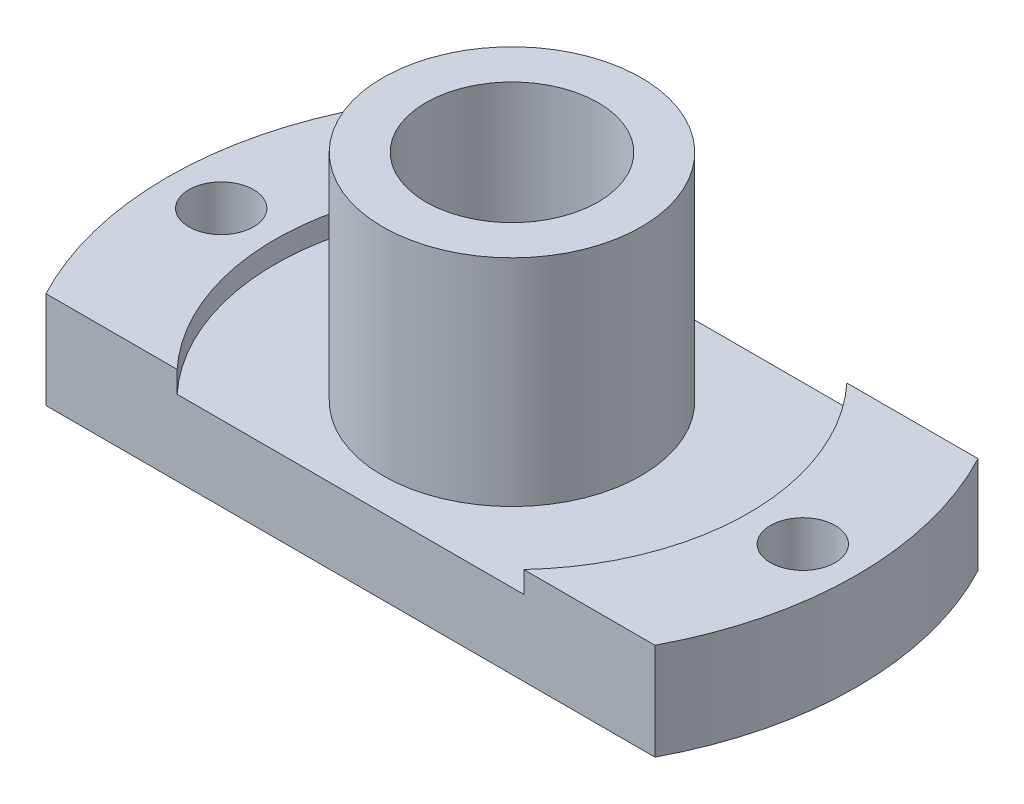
from build123d import *

# Parameters (mm, degrees)
SKETCH_1_R          = 12
SKETCH_1_R_2        = 8
EXTRUDE_1_DEPTH     = 27
SKETCH_2_R          = 8
EXTRUDE_2_DEPTH     = 7
EXTRUDE_3_DEPTH     = 2
SKETCH_4_R          = 3
CUT_EXTRUDE_1_DEPTH = 40.66106403


with BuildPart() as part:
    # Sketch 1 → Extrude 1 (new body)
    with BuildSketch(Plane(origin=(0, 0, 0), x_dir=(1, 0, 0), z_dir=(0, 1, 0))):
        with Locations(Location((0, 0, 0), (0, 0, 270))):
            Circle(SKETCH_1_R)
        with Locations(Location((0, 0, 0), (0, 0, 270))):
            Circle(SKETCH_1_R_2, mode=Mode.SUBTRACT)
    extrude(amount=EXTRUDE_1_DEPTH)

    # Sketch 2 → Extrude 2 (add)
    with BuildSketch(Plane.XZ):
        with BuildLine():
            Line((-28.26658805, -15), (28.26658805, -15))
            ThreePointArc((28.26658805, -15), (32, 0), (28.26658805, 15))
            Line((28.26658805, 15), (-28.26658805, 15))
            ThreePointArc((-28.26658805, 15), (-32, 0), (-28.26658805, -15))
        make_face()
        with Locations(Location((0, 0, 0), (0, 0, 90))):
            Circle(SKETCH_2_R, mode=Mode.SUBTRACT)
    extrude(amount=-EXTRUDE_2_DEPTH)

    # Sketch 3 → Extrude 3 (add)
    with BuildSketch(Plane(origin=(0, 7, 0), x_dir=(1, 0, 0), z_dir=(0, 1, 0))):
        with BuildLine():
            Line((28.26658805, 15), (16.093476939, 15))
            ThreePointArc((16.093476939, 15), (22, 0), (16.093476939, -15))
            Line((16.093476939, -15), (28.26658805, -15))
            ThreePointArc((28.26658805, -15), (32, 0), (28.26658805, 15))
        make_face()
        with BuildLine():
            Line((-28.26658805, -15), (-16.093476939, -15))
            ThreePointArc((-16.093476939, -15), (-22, 0), (-16.093476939, 15))
            Line((-16.093476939, 15), (-28.26658805, 15))
            ThreePointArc((-28.26658805, 15), (-32, 0), (-28.26658805, -15))
        make_face()
    extrude(amount=EXTRUDE_3_DEPTH)

    # Sketch 4 → Cut-Extrude 1 (cut, through all)
    with BuildSketch(Plane(origin=(0, 9, 0), x_dir=(1, 0, 0), z_dir=(0, 1, 0))):
        with Locations(Location((27, 0, 0), (0, 0, 270))):
            Circle(SKETCH_4_R)
        with Locations(Location((-27, 0, 0), (0, 0, 90))):
            Circle(SKETCH_4_R)
    extrude(amount=-CUT_EXTRUDE_1_DEPTH, mode=Mode.SUBTRACT)


solid = part.part
